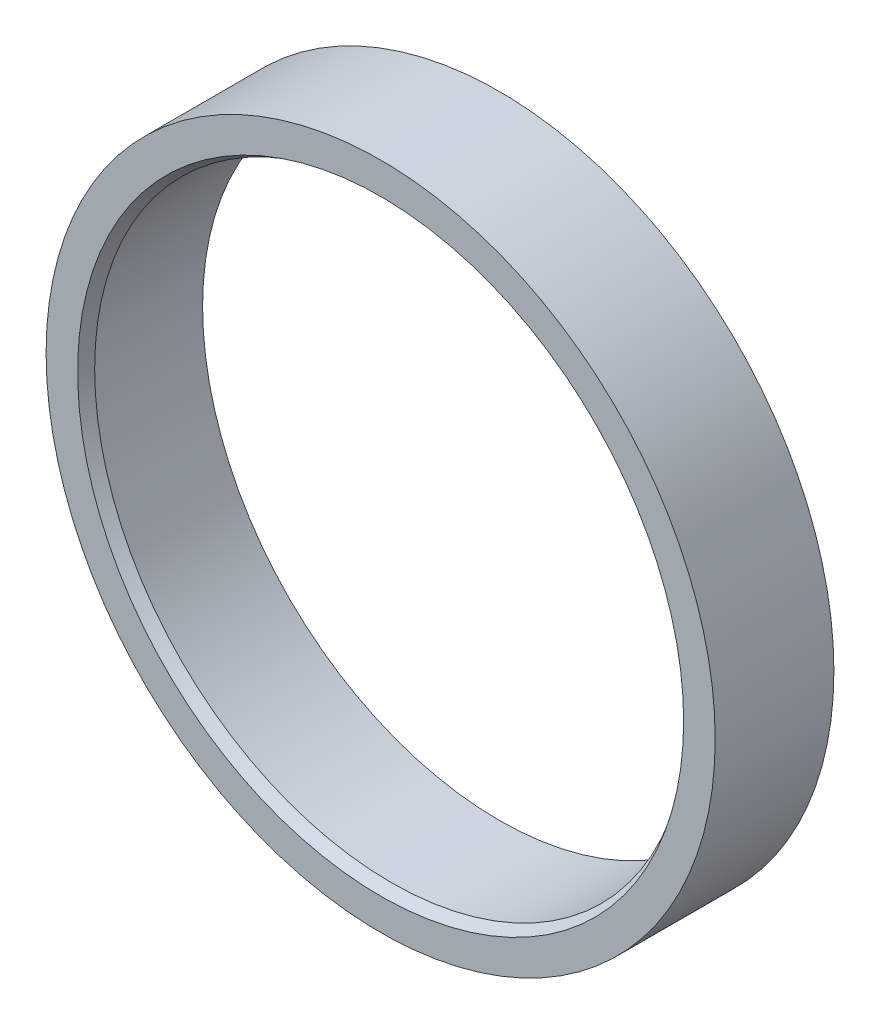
from build123d import *


with BuildPart() as part:
    # Esquisse1 → R_volution1 (revolve)
    with BuildSketch(Plane(origin=(0, 0, 0), x_dir=(0, 0, -1), z_dir=(1, 0, 0)), mode=Mode.PRIVATE) as r_volution1_sk:
        Polygon((1, 27.5), (11, 27.5), (11, 31), (0, 31), (0, 28.077350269), align=None)
    revolve(r_volution1_sk.sketch.rotate(Axis((0, 0, 0), (0, 0, -1)), 90), axis=Axis((0, 0, 0), (0, 0, -1)))


solid = part.part
